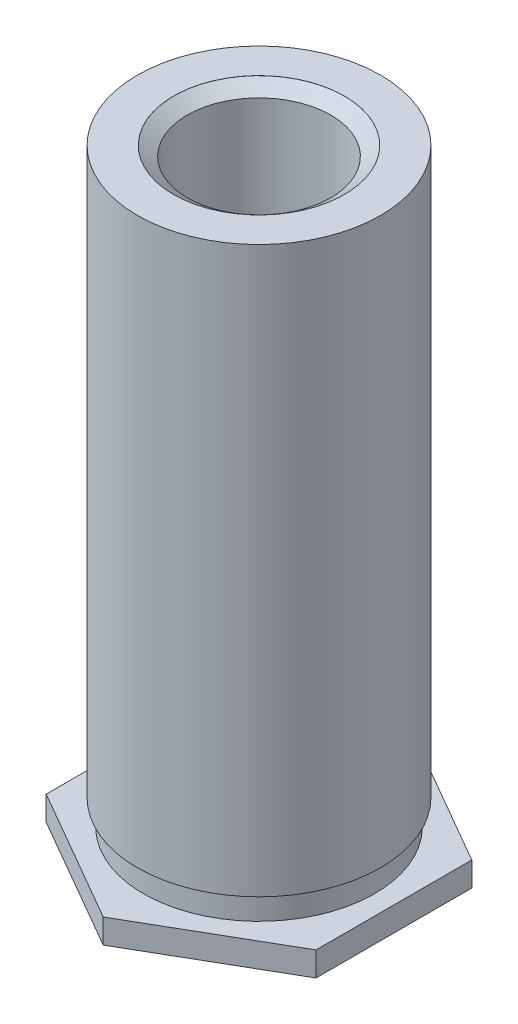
ISO-10303-21;
HEADER;
FILE_DESCRIPTION(('STEP AP214'),'2;1');
FILE_NAME('part.step','',(''),(''),'','','');
FILE_SCHEMA(('AUTOMOTIVE_DESIGN { 1 0 10303 214 1 1 1 1 }'));
ENDSEC;
DATA;
#1=APPLICATION_CONTEXT('core data for automotive mechanical design processes');
#2=APPLICATION_PROTOCOL_DEFINITION('international standard','automotive_design',2000,#1);
#3=PRODUCT_CONTEXT('',#1,'mechanical');
#4=PRODUCT('Part','Part','',(#3));
#5=PRODUCT_RELATED_PRODUCT_CATEGORY('part','',(#4));
#6=PRODUCT_DEFINITION_FORMATION('','',#4);
#7=PRODUCT_DEFINITION_CONTEXT('part definition',#1,'design');
#8=PRODUCT_DEFINITION('design','',#6,#7);
#9=PRODUCT_DEFINITION_SHAPE('','',#8);
#10=(LENGTH_UNIT() NAMED_UNIT(*) SI_UNIT(.MILLI.,.METRE.));
#11=(NAMED_UNIT(*) PLANE_ANGLE_UNIT() SI_UNIT($,.RADIAN.));
#12=(NAMED_UNIT(*) SI_UNIT($,.STERADIAN.) SOLID_ANGLE_UNIT());
#13=UNCERTAINTY_MEASURE_WITH_UNIT(LENGTH_MEASURE(1.E-05),#10,'distance_accuracy_value','');
#14=(GEOMETRIC_REPRESENTATION_CONTEXT(3) GLOBAL_UNCERTAINTY_ASSIGNED_CONTEXT((#13)) GLOBAL_UNIT_ASSIGNED_CONTEXT((#10,
#11,#12)) REPRESENTATION_CONTEXT('',''));
#15=CARTESIAN_POINT('',(0.,0.,0.));
#16=DIRECTION('',(0.,0.,1.));
#17=DIRECTION('',(1.,0.,0.));
#18=AXIS2_PLACEMENT_3D('',#15,#16,#17);
#19=CARTESIAN_POINT('',(4.582,0.712,0.));
#20=DIRECTION('',(0.,1.,0.));
#21=DIRECTION('',(0.,0.,1.));
#22=AXIS2_PLACEMENT_3D('',#19,#20,#21);
#23=PLANE('',#22);
#24=CARTESIAN_POINT('',(0.,0.712,0.));
#25=DIRECTION('',(0.,-1.,0.));
#26=DIRECTION('',(0.,0.,-1.));
#27=AXIS2_PLACEMENT_3D('',#24,#25,#26);
#28=CIRCLE('',#27,3.382);
#29=CARTESIAN_POINT('',(0.,0.712,-3.382));
#30=VERTEX_POINT('',#29);
#31=EDGE_CURVE('E11',#30,#30,#28,.T.);
#32=ORIENTED_EDGE('',*,*,#31,.T.);
#33=EDGE_LOOP('',(#32));
#34=FACE_BOUND('',#33,.T.);
#35=DIRECTION('',(0.866025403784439,0.,0.5));
#36=VECTOR('',#35,1.);
#37=CARTESIAN_POINT('',(0.,0.712,4.56106712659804));
#38=LINE('',#37,#36);
#39=CARTESIAN_POINT('',(-3.95,0.712,2.28053356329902));
#40=VERTEX_POINT('',#39);
#41=CARTESIAN_POINT('',(0.,0.712,4.56106712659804));
#42=VERTEX_POINT('',#41);
#43=EDGE_CURVE('E131',#40,#42,#38,.T.);
#44=ORIENTED_EDGE('',*,*,#43,.T.);
#45=DIRECTION('',(0.866025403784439,0.,-0.5));
#46=VECTOR('',#45,1.);
#47=CARTESIAN_POINT('',(3.95,0.712,2.28053356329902));
#48=LINE('',#47,#46);
#49=CARTESIAN_POINT('',(3.95,0.712,2.28053356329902));
#50=VERTEX_POINT('',#49);
#51=EDGE_CURVE('E120',#42,#50,#48,.T.);
#52=ORIENTED_EDGE('',*,*,#51,.T.);
#53=DIRECTION('',(0.,0.,-1.));
#54=VECTOR('',#53,1.);
#55=CARTESIAN_POINT('',(3.95,0.712,-2.28053356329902));
#56=LINE('',#55,#54);
#57=CARTESIAN_POINT('',(3.95,0.712,-2.28053356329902));
#58=VERTEX_POINT('',#57);
#59=EDGE_CURVE('E123',#50,#58,#56,.T.);
#60=ORIENTED_EDGE('',*,*,#59,.T.);
#61=DIRECTION('',(-0.866025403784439,0.,-0.5));
#62=VECTOR('',#61,1.);
#63=CARTESIAN_POINT('',(0.,0.712,-4.56106712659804));
#64=LINE('',#63,#62);
#65=CARTESIAN_POINT('',(0.,0.712,-4.56106712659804));
#66=VERTEX_POINT('',#65);
#67=EDGE_CURVE('E48',#58,#66,#64,.T.);
#68=ORIENTED_EDGE('',*,*,#67,.T.);
#69=DIRECTION('',(-0.866025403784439,0.,0.5));
#70=VECTOR('',#69,1.);
#71=CARTESIAN_POINT('',(-3.95,0.712,-2.28053356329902));
#72=LINE('',#71,#70);
#73=CARTESIAN_POINT('',(-3.95,0.712,-2.28053356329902));
#74=VERTEX_POINT('',#73);
#75=EDGE_CURVE('E96',#66,#74,#72,.T.);
#76=ORIENTED_EDGE('',*,*,#75,.T.);
#77=DIRECTION('',(0.,0.,1.));
#78=VECTOR('',#77,1.);
#79=CARTESIAN_POINT('',(-3.95,0.712,2.28053356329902));
#80=LINE('',#79,#78);
#81=EDGE_CURVE('E128',#74,#40,#80,.T.);
#82=ORIENTED_EDGE('',*,*,#81,.T.);
#83=EDGE_LOOP('',(#44,#52,#60,#68,#76,#82));
#84=FACE_BOUND('',#83,.T.);
#85=ADVANCED_FACE('F33',(#34,#84),#23,.T.);
#86=CARTESIAN_POINT('',(0.,0.,0.));
#87=DIRECTION('',(0.,-1.,0.));
#88=DIRECTION('',(0.,0.,-1.));
#89=AXIS2_PLACEMENT_3D('',#86,#87,#88);
#90=CYLINDRICAL_SURFACE('',#89,3.382);
#91=CARTESIAN_POINT('',(0.,1.4596,0.));
#92=DIRECTION('',(0.,-1.,0.));
#93=DIRECTION('',(0.,0.,-1.));
#94=AXIS2_PLACEMENT_3D('',#91,#92,#93);
#95=CIRCLE('',#94,3.382);
#96=CARTESIAN_POINT('',(0.,1.4596,-3.382));
#97=VERTEX_POINT('',#96);
#98=EDGE_CURVE('E41',#97,#97,#95,.T.);
#99=ORIENTED_EDGE('',*,*,#98,.T.);
#100=EDGE_LOOP('',(#99));
#101=FACE_BOUND('',#100,.T.);
#102=ORIENTED_EDGE('',*,*,#31,.F.);
#103=EDGE_LOOP('',(#102));
#104=FACE_BOUND('',#103,.T.);
#105=ADVANCED_FACE('F165',(#101,#104),#90,.T.);
#106=CARTESIAN_POINT('',(3.56,1.4596,0.));
#107=DIRECTION('',(0.,-1.,0.));
#108=DIRECTION('',(0.,0.,-1.));
#109=AXIS2_PLACEMENT_3D('',#106,#107,#108);
#110=PLANE('',#109);
#111=CARTESIAN_POINT('',(0.,1.4596,0.));
#112=DIRECTION('',(0.,-1.,0.));
#113=DIRECTION('',(0.,0.,-1.));
#114=AXIS2_PLACEMENT_3D('',#111,#112,#113);
#115=CIRCLE('',#114,3.56);
#116=CARTESIAN_POINT('',(0.,1.4596,-3.56));
#117=VERTEX_POINT('',#116);
#118=EDGE_CURVE('E159',#117,#117,#115,.T.);
#119=ORIENTED_EDGE('',*,*,#118,.T.);
#120=EDGE_LOOP('',(#119));
#121=FACE_BOUND('',#120,.T.);
#122=ORIENTED_EDGE('',*,*,#98,.F.);
#123=EDGE_LOOP('',(#122));
#124=FACE_BOUND('',#123,.T.);
#125=ADVANCED_FACE('F168',(#121,#124),#110,.T.);
#126=CARTESIAN_POINT('',(0.,0.,0.));
#127=DIRECTION('',(0.,-1.,0.));
#128=DIRECTION('',(0.,0.,-1.));
#129=AXIS2_PLACEMENT_3D('',#126,#127,#128);
#130=CYLINDRICAL_SURFACE('',#129,3.56);
#131=CARTESIAN_POINT('',(0.,18.,0.));
#132=DIRECTION('',(0.,-1.,0.));
#133=DIRECTION('',(0.,0.,-1.));
#134=AXIS2_PLACEMENT_3D('',#131,#132,#133);
#135=CIRCLE('',#134,3.56);
#136=CARTESIAN_POINT('',(0.,18.,-3.56));
#137=VERTEX_POINT('',#136);
#138=EDGE_CURVE('E156',#137,#137,#135,.T.);
#139=ORIENTED_EDGE('',*,*,#138,.T.);
#140=EDGE_LOOP('',(#139));
#141=FACE_BOUND('',#140,.T.);
#142=ORIENTED_EDGE('',*,*,#118,.F.);
#143=EDGE_LOOP('',(#142));
#144=FACE_BOUND('',#143,.T.);
#145=ADVANCED_FACE('F170',(#141,#144),#130,.T.);
#146=CARTESIAN_POINT('',(3.56,18.,0.));
#147=DIRECTION('',(0.,1.,0.));
#148=DIRECTION('',(0.,0.,1.));
#149=AXIS2_PLACEMENT_3D('',#146,#147,#148);
#150=PLANE('',#149);
#151=CARTESIAN_POINT('',(0.,18.,0.));
#152=DIRECTION('',(0.,1.,0.));
#153=DIRECTION('',(0.,0.,1.));
#154=AXIS2_PLACEMENT_3D('',#151,#152,#153);
#155=CIRCLE('',#154,2.5);
#156=CARTESIAN_POINT('',(0.,18.,2.5));
#157=VERTEX_POINT('',#156);
#158=EDGE_CURVE('E36',#157,#157,#155,.T.);
#159=ORIENTED_EDGE('',*,*,#158,.F.);
#160=EDGE_LOOP('',(#159));
#161=FACE_BOUND('',#160,.T.);
#162=ORIENTED_EDGE('',*,*,#138,.F.);
#163=EDGE_LOOP('',(#162));
#164=FACE_BOUND('',#163,.T.);
#165=ADVANCED_FACE('F177',(#161,#164),#150,.T.);
#166=CARTESIAN_POINT('',(0.,-2.54,0.));
#167=DIRECTION('',(0.,-1.,0.));
#168=DIRECTION('',(0.,0.,-1.));
#169=AXIS2_PLACEMENT_3D('',#166,#167,#168);
#170=CYLINDRICAL_SURFACE('',#169,2.5);
#171=ORIENTED_EDGE('',*,*,#158,.T.);
#172=EDGE_LOOP('',(#171));
#173=FACE_BOUND('',#172,.T.);
#174=CARTESIAN_POINT('',(0.,17.99746,0.));
#175=DIRECTION('',(0.,-1.,0.));
#176=DIRECTION('',(0.,0.,-1.));
#177=AXIS2_PLACEMENT_3D('',#174,#175,#176);
#178=CIRCLE('',#177,2.5);
#179=CARTESIAN_POINT('',(0.,17.99746,-2.5));
#180=VERTEX_POINT('',#179);
#181=EDGE_CURVE('E136',#180,#180,#178,.T.);
#182=ORIENTED_EDGE('',*,*,#181,.T.);
#183=EDGE_LOOP('',(#182));
#184=FACE_BOUND('',#183,.T.);
#185=ADVANCED_FACE('F216',(#173,#184),#170,.F.);
#186=CARTESIAN_POINT('',(0.,17.7174810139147,0.));
#187=DIRECTION('',(0.,1.,0.));
#188=DIRECTION('',(0.,0.,1.));
#189=AXIS2_PLACEMENT_3D('',#186,#187,#188);
#190=CONICAL_SURFACE('',#189,2.1,0.960105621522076);
#191=ORIENTED_EDGE('',*,*,#181,.F.);
#192=EDGE_LOOP('',(#191));
#193=FACE_BOUND('',#192,.T.);
#194=CARTESIAN_POINT('',(0.,17.7174810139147,0.));
#195=DIRECTION('',(0.,-1.,0.));
#196=DIRECTION('',(0.,0.,-1.));
#197=AXIS2_PLACEMENT_3D('',#194,#195,#196);
#198=CIRCLE('',#197,2.1);
#199=CARTESIAN_POINT('',(0.,17.7174810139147,-2.1));
#200=VERTEX_POINT('',#199);
#201=EDGE_CURVE('E144',#200,#200,#198,.T.);
#202=ORIENTED_EDGE('',*,*,#201,.T.);
#203=EDGE_LOOP('',(#202));
#204=FACE_BOUND('',#203,.T.);
#205=ADVANCED_FACE('F212',(#193,#204),#190,.F.);
#206=CARTESIAN_POINT('',(0.,3.6301515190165,0.));
#207=DIRECTION('',(0.,1.,0.));
#208=DIRECTION('',(0.,0.,1.));
#209=AXIS2_PLACEMENT_3D('',#206,#207,#208);
#210=CONICAL_SURFACE('',#209,0.,1.17809724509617);
#211=CARTESIAN_POINT('',(0.,4.5,0.));
#212=DIRECTION('',(0.,-1.,0.));
#213=DIRECTION('',(0.,0.,-1.));
#214=AXIS2_PLACEMENT_3D('',#211,#212,#213);
#215=CIRCLE('',#214,2.1);
#216=CARTESIAN_POINT('',(0.,4.5,-2.1));
#217=VERTEX_POINT('',#216);
#218=EDGE_CURVE('E147',#217,#217,#215,.T.);
#219=ORIENTED_EDGE('',*,*,#218,.F.);
#220=EDGE_LOOP('',(#219));
#221=FACE_BOUND('',#220,.T.);
#222=CARTESIAN_POINT('',(0.,3.6301515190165,0.));
#223=VERTEX_POINT('',#222);
#224=VERTEX_LOOP('',#223);
#225=FACE_BOUND('',#224,.T.);
#226=ADVANCED_FACE('F215',(#221,#225),#210,.F.);
#227=CARTESIAN_POINT('',(0.,0.,0.));
#228=DIRECTION('',(0.,-1.,0.));
#229=DIRECTION('',(0.,0.,-1.));
#230=AXIS2_PLACEMENT_3D('',#227,#228,#229);
#231=CYLINDRICAL_SURFACE('',#230,2.1);
#232=ORIENTED_EDGE('',*,*,#201,.F.);
#233=EDGE_LOOP('',(#232));
#234=FACE_BOUND('',#233,.T.);
#235=ORIENTED_EDGE('',*,*,#218,.T.);
#236=EDGE_LOOP('',(#235));
#237=FACE_BOUND('',#236,.T.);
#238=ADVANCED_FACE('F211',(#234,#237),#231,.F.);
#239=CARTESIAN_POINT('',(3.95,0.,2.28053356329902));
#240=DIRECTION('',(0.5,0.,0.866025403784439));
#241=DIRECTION('',(0.866025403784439,0.,-0.5));
#242=AXIS2_PLACEMENT_3D('',#239,#240,#241);
#243=PLANE('',#242);
#244=ORIENTED_EDGE('',*,*,#51,.F.);
#245=DIRECTION('',(0.,1.,0.));
#246=VECTOR('',#245,1.);
#247=CARTESIAN_POINT('',(0.,0.,4.56106712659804));
#248=LINE('',#247,#246);
#249=CARTESIAN_POINT('',(0.,0.,4.56106712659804));
#250=VERTEX_POINT('',#249);
#251=EDGE_CURVE('E134',#250,#42,#248,.T.);
#252=ORIENTED_EDGE('',*,*,#251,.F.);
#253=DIRECTION('',(0.866025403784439,0.,-0.5));
#254=VECTOR('',#253,1.);
#255=CARTESIAN_POINT('',(3.95,0.,2.28053356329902));
#256=LINE('',#255,#254);
#257=CARTESIAN_POINT('',(3.95,0.,2.28053356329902));
#258=VERTEX_POINT('',#257);
#259=EDGE_CURVE('E56',#250,#258,#256,.T.);
#260=ORIENTED_EDGE('',*,*,#259,.T.);
#261=DIRECTION('',(0.,1.,0.));
#262=VECTOR('',#261,1.);
#263=CARTESIAN_POINT('',(3.95,0.,2.28053356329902));
#264=LINE('',#263,#262);
#265=EDGE_CURVE('E119',#258,#50,#264,.T.);
#266=ORIENTED_EDGE('',*,*,#265,.T.);
#267=EDGE_LOOP('',(#244,#252,#260,#266));
#268=FACE_BOUND('',#267,.T.);
#269=ADVANCED_FACE('F191',(#268),#243,.T.);
#270=CARTESIAN_POINT('',(0.,0.,4.56106712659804));
#271=DIRECTION('',(-0.5,0.,0.866025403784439));
#272=DIRECTION('',(0.866025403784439,0.,0.5));
#273=AXIS2_PLACEMENT_3D('',#270,#271,#272);
#274=PLANE('',#273);
#275=ORIENTED_EDGE('',*,*,#43,.F.);
#276=DIRECTION('',(0.,1.,0.));
#277=VECTOR('',#276,1.);
#278=CARTESIAN_POINT('',(-3.95,0.,2.28053356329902));
#279=LINE('',#278,#277);
#280=CARTESIAN_POINT('',(-3.95,0.,2.28053356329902));
#281=VERTEX_POINT('',#280);
#282=EDGE_CURVE('E137',#281,#40,#279,.T.);
#283=ORIENTED_EDGE('',*,*,#282,.F.);
#284=DIRECTION('',(0.866025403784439,0.,0.5));
#285=VECTOR('',#284,1.);
#286=CARTESIAN_POINT('',(0.,0.,4.56106712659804));
#287=LINE('',#286,#285);
#288=EDGE_CURVE('E113',#281,#250,#287,.T.);
#289=ORIENTED_EDGE('',*,*,#288,.T.);
#290=ORIENTED_EDGE('',*,*,#251,.T.);
#291=EDGE_LOOP('',(#275,#283,#289,#290));
#292=FACE_BOUND('',#291,.T.);
#293=ADVANCED_FACE('F190',(#292),#274,.T.);
#294=CARTESIAN_POINT('',(-3.95,0.,2.28053356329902));
#295=DIRECTION('',(-1.,0.,0.));
#296=DIRECTION('',(0.,0.,1.));
#297=AXIS2_PLACEMENT_3D('',#294,#295,#296);
#298=PLANE('',#297);
#299=ORIENTED_EDGE('',*,*,#81,.F.);
#300=DIRECTION('',(0.,1.,0.));
#301=VECTOR('',#300,1.);
#302=CARTESIAN_POINT('',(-3.95,0.,-2.28053356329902));
#303=LINE('',#302,#301);
#304=CARTESIAN_POINT('',(-3.95,0.,-2.28053356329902));
#305=VERTEX_POINT('',#304);
#306=EDGE_CURVE('E97',#305,#74,#303,.T.);
#307=ORIENTED_EDGE('',*,*,#306,.F.);
#308=DIRECTION('',(0.,0.,1.));
#309=VECTOR('',#308,1.);
#310=CARTESIAN_POINT('',(-3.95,0.,2.28053356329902));
#311=LINE('',#310,#309);
#312=EDGE_CURVE('E111',#305,#281,#311,.T.);
#313=ORIENTED_EDGE('',*,*,#312,.T.);
#314=ORIENTED_EDGE('',*,*,#282,.T.);
#315=EDGE_LOOP('',(#299,#307,#313,#314));
#316=FACE_BOUND('',#315,.T.);
#317=ADVANCED_FACE('F279',(#316),#298,.T.);
#318=CARTESIAN_POINT('',(-3.95,0.,-2.28053356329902));
#319=DIRECTION('',(-0.5,0.,-0.866025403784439));
#320=DIRECTION('',(-0.866025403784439,0.,0.5));
#321=AXIS2_PLACEMENT_3D('',#318,#319,#320);
#322=PLANE('',#321);
#323=ORIENTED_EDGE('',*,*,#75,.F.);
#324=DIRECTION('',(0.,1.,0.));
#325=VECTOR('',#324,1.);
#326=CARTESIAN_POINT('',(0.,0.,-4.56106712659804));
#327=LINE('',#326,#325);
#328=CARTESIAN_POINT('',(0.,0.,-4.56106712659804));
#329=VERTEX_POINT('',#328);
#330=EDGE_CURVE('E89',#329,#66,#327,.T.);
#331=ORIENTED_EDGE('',*,*,#330,.F.);
#332=DIRECTION('',(-0.866025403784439,0.,0.5));
#333=VECTOR('',#332,1.);
#334=CARTESIAN_POINT('',(-3.95,0.,-2.28053356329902));
#335=LINE('',#334,#333);
#336=EDGE_CURVE('E93',#329,#305,#335,.T.);
#337=ORIENTED_EDGE('',*,*,#336,.T.);
#338=ORIENTED_EDGE('',*,*,#306,.T.);
#339=EDGE_LOOP('',(#323,#331,#337,#338));
#340=FACE_BOUND('',#339,.T.);
#341=ADVANCED_FACE('F91',(#340),#322,.T.);
#342=CARTESIAN_POINT('',(0.,0.,-4.56106712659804));
#343=DIRECTION('',(0.5,0.,-0.866025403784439));
#344=DIRECTION('',(-0.866025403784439,0.,-0.5));
#345=AXIS2_PLACEMENT_3D('',#342,#343,#344);
#346=PLANE('',#345);
#347=ORIENTED_EDGE('',*,*,#67,.F.);
#348=DIRECTION('',(0.,1.,0.));
#349=VECTOR('',#348,1.);
#350=CARTESIAN_POINT('',(3.95,0.,-2.28053356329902));
#351=LINE('',#350,#349);
#352=CARTESIAN_POINT('',(3.95,0.,-2.28053356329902));
#353=VERTEX_POINT('',#352);
#354=EDGE_CURVE('E98',#353,#58,#351,.T.);
#355=ORIENTED_EDGE('',*,*,#354,.F.);
#356=DIRECTION('',(-0.866025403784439,0.,-0.5));
#357=VECTOR('',#356,1.);
#358=CARTESIAN_POINT('',(0.,0.,-4.56106712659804));
#359=LINE('',#358,#357);
#360=EDGE_CURVE('E101',#353,#329,#359,.T.);
#361=ORIENTED_EDGE('',*,*,#360,.T.);
#362=ORIENTED_EDGE('',*,*,#330,.T.);
#363=EDGE_LOOP('',(#347,#355,#361,#362));
#364=FACE_BOUND('',#363,.T.);
#365=ADVANCED_FACE('F102',(#364),#346,.T.);
#366=CARTESIAN_POINT('',(3.95,0.,-2.28053356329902));
#367=DIRECTION('',(1.,0.,0.));
#368=DIRECTION('',(0.,0.,-1.));
#369=AXIS2_PLACEMENT_3D('',#366,#367,#368);
#370=PLANE('',#369);
#371=ORIENTED_EDGE('',*,*,#59,.F.);
#372=ORIENTED_EDGE('',*,*,#265,.F.);
#373=DIRECTION('',(0.,0.,-1.));
#374=VECTOR('',#373,1.);
#375=CARTESIAN_POINT('',(3.95,0.,-2.28053356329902));
#376=LINE('',#375,#374);
#377=EDGE_CURVE('E106',#258,#353,#376,.T.);
#378=ORIENTED_EDGE('',*,*,#377,.T.);
#379=ORIENTED_EDGE('',*,*,#354,.T.);
#380=EDGE_LOOP('',(#371,#372,#378,#379));
#381=FACE_BOUND('',#380,.T.);
#382=ADVANCED_FACE('F194',(#381),#370,.T.);
#383=CARTESIAN_POINT('',(3.56,0.00253999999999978,0.));
#384=DIRECTION('',(0.,-1.,0.));
#385=DIRECTION('',(0.,0.,-1.));
#386=AXIS2_PLACEMENT_3D('',#383,#384,#385);
#387=PLANE('',#386);
#388=CARTESIAN_POINT('',(0.,0.00254,0.));
#389=DIRECTION('',(0.,-1.,0.));
#390=DIRECTION('',(0.,0.,-1.));
#391=AXIS2_PLACEMENT_3D('',#388,#389,#390);
#392=CIRCLE('',#391,3.56);
#393=CARTESIAN_POINT('',(0.,0.00254,-3.56));
#394=VERTEX_POINT('',#393);
#395=EDGE_CURVE('E153',#394,#394,#392,.T.);
#396=ORIENTED_EDGE('',*,*,#395,.T.);
#397=EDGE_LOOP('',(#396));
#398=FACE_BOUND('',#397,.T.);
#399=ADVANCED_FACE('F197',(#398),#387,.T.);
#400=CARTESIAN_POINT('',(0.,0.,0.));
#401=DIRECTION('',(0.,-1.,0.));
#402=DIRECTION('',(0.,0.,-1.));
#403=AXIS2_PLACEMENT_3D('',#400,#401,#402);
#404=CYLINDRICAL_SURFACE('',#403,3.56);
#405=CARTESIAN_POINT('',(0.,0.,0.));
#406=DIRECTION('',(0.,-1.,0.));
#407=DIRECTION('',(0.,0.,-1.));
#408=AXIS2_PLACEMENT_3D('',#405,#406,#407);
#409=CIRCLE('',#408,3.56);
#410=CARTESIAN_POINT('',(0.,0.,-3.56));
#411=VERTEX_POINT('',#410);
#412=EDGE_CURVE('E150',#411,#411,#409,.T.);
#413=ORIENTED_EDGE('',*,*,#412,.T.);
#414=EDGE_LOOP('',(#413));
#415=FACE_BOUND('',#414,.T.);
#416=ORIENTED_EDGE('',*,*,#395,.F.);
#417=EDGE_LOOP('',(#416));
#418=FACE_BOUND('',#417,.T.);
#419=ADVANCED_FACE('F203',(#415,#418),#404,.F.);
#420=CARTESIAN_POINT('',(3.56,0.,0.));
#421=DIRECTION('',(0.,-1.,0.));
#422=DIRECTION('',(0.,0.,-1.));
#423=AXIS2_PLACEMENT_3D('',#420,#421,#422);
#424=PLANE('',#423);
#425=ORIENTED_EDGE('',*,*,#412,.F.);
#426=EDGE_LOOP('',(#425));
#427=FACE_BOUND('',#426,.T.);
#428=ORIENTED_EDGE('',*,*,#377,.F.);
#429=ORIENTED_EDGE('',*,*,#259,.F.);
#430=ORIENTED_EDGE('',*,*,#288,.F.);
#431=ORIENTED_EDGE('',*,*,#312,.F.);
#432=ORIENTED_EDGE('',*,*,#336,.F.);
#433=ORIENTED_EDGE('',*,*,#360,.F.);
#434=EDGE_LOOP('',(#428,#429,#430,#431,#432,#433));
#435=FACE_BOUND('',#434,.T.);
#436=ADVANCED_FACE('F108',(#427,#435),#424,.T.);
#437=CLOSED_SHELL('',(#85,#105,#125,#145,#165,#185,#205,#226,#238,#269,#293,#317,#341,#365,#382,
#399,#419,#436));
#438=MANIFOLD_SOLID_BREP('B2',#437);
#439=ADVANCED_BREP_SHAPE_REPRESENTATION('',(#18,#438),#14);
#440=SHAPE_DEFINITION_REPRESENTATION(#9,#439);
ENDSEC;
END-ISO-10303-21;
